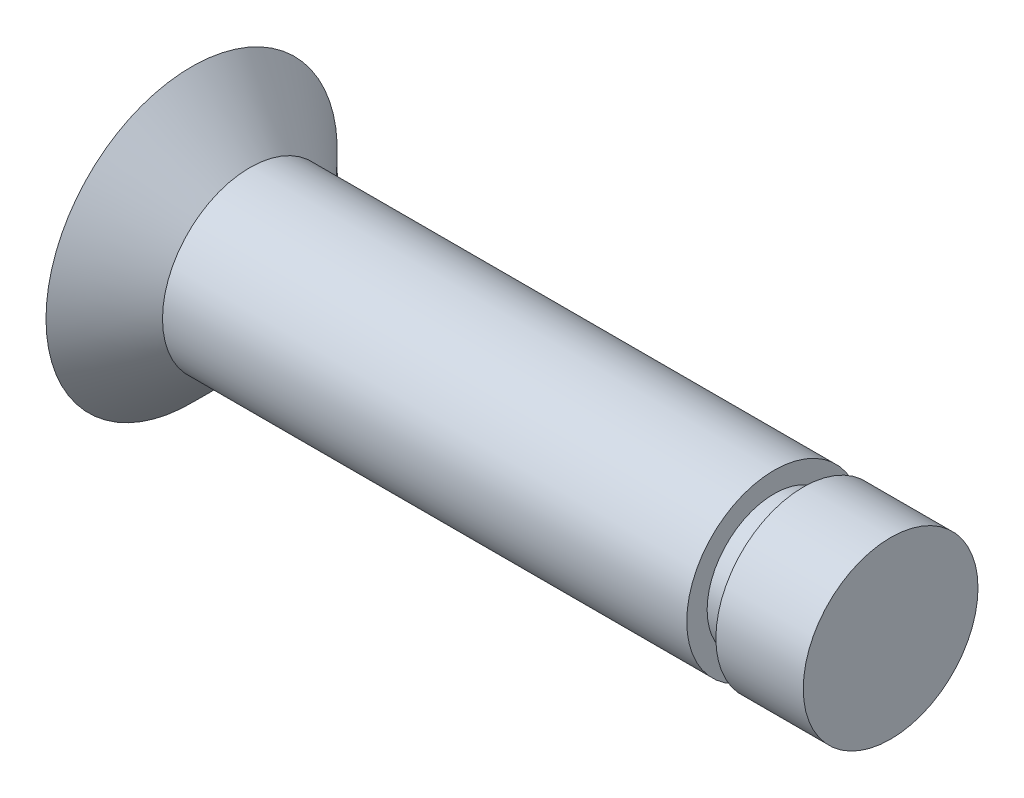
from build123d import *


with BuildPart() as part:
    # Esquisse1 → Base-R_volution (revolve)
    with BuildSketch(Plane.XY, mode=Mode.PRIVATE) as base_r_volution_sk:
        Polygon((0, 0), (0, 2.5), (1, 1.5), (10, 1.5), (10, 1.15), (10.5, 1.15), (10.5, 1.5), (12, 1.5), (12, 0), align=None)
    revolve(base_r_volution_sk.sketch.rotate(Axis((-40, 0, 0), (1, 0, 0)), 90), axis=Axis((-40, 0, 0), (1, 0, 0)))


solid = part.part
